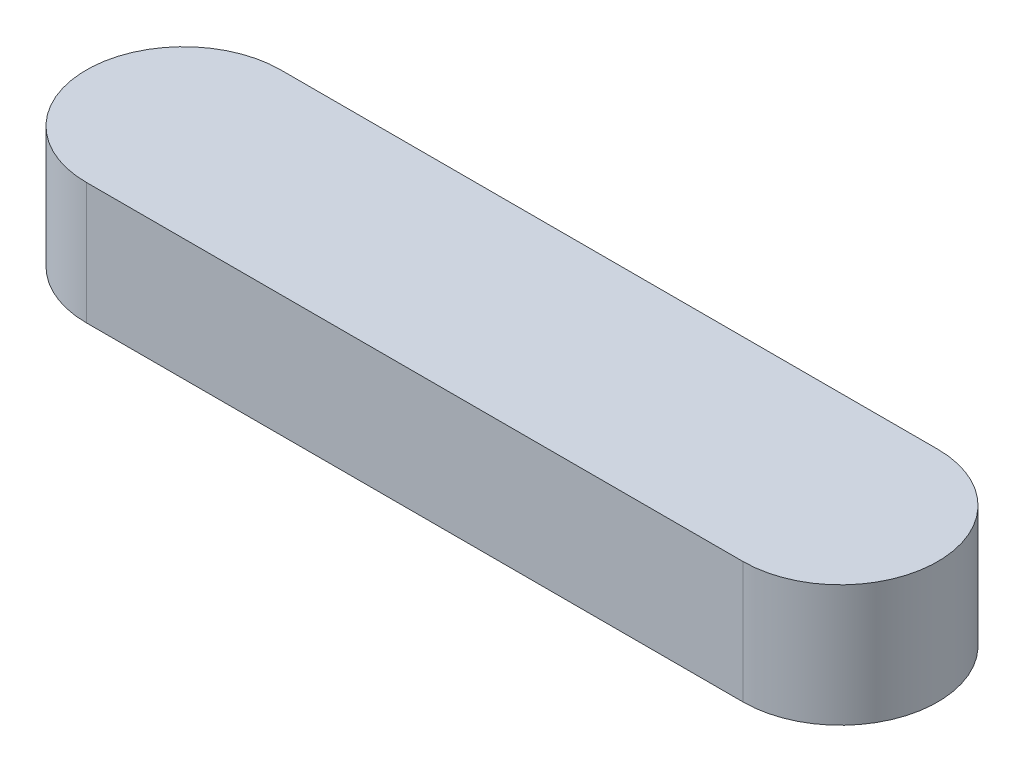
ISO-10303-21;
HEADER;
FILE_DESCRIPTION(('STEP AP214'),'2;1');
FILE_NAME('part.step','',(''),(''),'','','');
FILE_SCHEMA(('AUTOMOTIVE_DESIGN { 1 0 10303 214 1 1 1 1 }'));
ENDSEC;
DATA;
#1=APPLICATION_CONTEXT('core data for automotive mechanical design processes');
#2=APPLICATION_PROTOCOL_DEFINITION('international standard','automotive_design',2000,#1);
#3=PRODUCT_CONTEXT('',#1,'mechanical');
#4=PRODUCT('Part','Part','',(#3));
#5=PRODUCT_RELATED_PRODUCT_CATEGORY('part','',(#4));
#6=PRODUCT_DEFINITION_FORMATION('','',#4);
#7=PRODUCT_DEFINITION_CONTEXT('part definition',#1,'design');
#8=PRODUCT_DEFINITION('design','',#6,#7);
#9=PRODUCT_DEFINITION_SHAPE('','',#8);
#10=(LENGTH_UNIT() NAMED_UNIT(*) SI_UNIT(.MILLI.,.METRE.));
#11=(NAMED_UNIT(*) PLANE_ANGLE_UNIT() SI_UNIT($,.RADIAN.));
#12=(NAMED_UNIT(*) SI_UNIT($,.STERADIAN.) SOLID_ANGLE_UNIT());
#13=UNCERTAINTY_MEASURE_WITH_UNIT(LENGTH_MEASURE(1.E-05),#10,'distance_accuracy_value','');
#14=(GEOMETRIC_REPRESENTATION_CONTEXT(3) GLOBAL_UNCERTAINTY_ASSIGNED_CONTEXT((#13)) GLOBAL_UNIT_ASSIGNED_CONTEXT((#10,
#11,#12)) REPRESENTATION_CONTEXT('',''));
#15=CARTESIAN_POINT('',(0.,0.,0.));
#16=DIRECTION('',(0.,0.,1.));
#17=DIRECTION('',(1.,0.,0.));
#18=AXIS2_PLACEMENT_3D('',#15,#16,#17);
#19=CARTESIAN_POINT('',(54.,10.,0.));
#20=DIRECTION('',(0.,-1.,0.));
#21=DIRECTION('',(0.,0.,-1.));
#22=AXIS2_PLACEMENT_3D('',#19,#20,#21);
#23=CYLINDRICAL_SURFACE('',#22,8.00000000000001);
#24=CARTESIAN_POINT('',(54.,0.,0.));
#25=DIRECTION('',(0.,1.,0.));
#26=DIRECTION('',(0.,0.,1.));
#27=AXIS2_PLACEMENT_3D('',#24,#25,#26);
#28=CIRCLE('',#27,8.00000000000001);
#29=CARTESIAN_POINT('',(54.,0.,8.00000000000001));
#30=VERTEX_POINT('',#29);
#31=CARTESIAN_POINT('',(54.,0.,-8.00000000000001));
#32=VERTEX_POINT('',#31);
#33=EDGE_CURVE('E95',#30,#32,#28,.T.);
#34=ORIENTED_EDGE('',*,*,#33,.T.);
#35=DIRECTION('',(0.,-1.,0.));
#36=VECTOR('',#35,1.);
#37=CARTESIAN_POINT('',(54.,10.,-8.00000000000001));
#38=LINE('',#37,#36);
#39=CARTESIAN_POINT('',(54.,10.,-8.00000000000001));
#40=VERTEX_POINT('',#39);
#41=EDGE_CURVE('E11',#40,#32,#38,.T.);
#42=ORIENTED_EDGE('',*,*,#41,.F.);
#43=CARTESIAN_POINT('',(54.,10.,0.));
#44=DIRECTION('',(0.,1.,0.));
#45=DIRECTION('',(0.,0.,1.));
#46=AXIS2_PLACEMENT_3D('',#43,#44,#45);
#47=CIRCLE('',#46,8.00000000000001);
#48=CARTESIAN_POINT('',(54.,10.,8.00000000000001));
#49=VERTEX_POINT('',#48);
#50=EDGE_CURVE('E83',#49,#40,#47,.T.);
#51=ORIENTED_EDGE('',*,*,#50,.F.);
#52=DIRECTION('',(0.,-1.,0.));
#53=VECTOR('',#52,1.);
#54=CARTESIAN_POINT('',(54.,10.,8.00000000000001));
#55=LINE('',#54,#53);
#56=EDGE_CURVE('E91',#49,#30,#55,.T.);
#57=ORIENTED_EDGE('',*,*,#56,.T.);
#58=EDGE_LOOP('',(#34,#42,#51,#57));
#59=FACE_BOUND('',#58,.T.);
#60=ADVANCED_FACE('F32',(#59),#23,.T.);
#61=CARTESIAN_POINT('',(54.,10.,-8.00000000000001));
#62=DIRECTION('',(0.,0.,1.));
#63=DIRECTION('',(1.,0.,0.));
#64=AXIS2_PLACEMENT_3D('',#61,#62,#63);
#65=PLANE('',#64);
#66=DIRECTION('',(-1.,0.,0.));
#67=VECTOR('',#66,1.);
#68=CARTESIAN_POINT('',(54.,0.,-8.00000000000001));
#69=LINE('',#68,#67);
#70=CARTESIAN_POINT('',(0.,0.,-8.00000000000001));
#71=VERTEX_POINT('',#70);
#72=EDGE_CURVE('E87',#32,#71,#69,.T.);
#73=ORIENTED_EDGE('',*,*,#72,.T.);
#74=DIRECTION('',(0.,-1.,0.));
#75=VECTOR('',#74,1.);
#76=CARTESIAN_POINT('',(0.,10.,-8.00000000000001));
#77=LINE('',#76,#75);
#78=CARTESIAN_POINT('',(0.,10.,-8.00000000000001));
#79=VERTEX_POINT('',#78);
#80=EDGE_CURVE('E40',#79,#71,#77,.T.);
#81=ORIENTED_EDGE('',*,*,#80,.F.);
#82=DIRECTION('',(-1.,0.,0.));
#83=VECTOR('',#82,1.);
#84=CARTESIAN_POINT('',(54.,10.,-8.00000000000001));
#85=LINE('',#84,#83);
#86=EDGE_CURVE('E78',#40,#79,#85,.T.);
#87=ORIENTED_EDGE('',*,*,#86,.F.);
#88=ORIENTED_EDGE('',*,*,#41,.T.);
#89=EDGE_LOOP('',(#73,#81,#87,#88));
#90=FACE_BOUND('',#89,.T.);
#91=ADVANCED_FACE('F86',(#90),#65,.F.);
#92=CARTESIAN_POINT('',(0.,10.,0.));
#93=DIRECTION('',(0.,-1.,0.));
#94=DIRECTION('',(0.,0.,-1.));
#95=AXIS2_PLACEMENT_3D('',#92,#93,#94);
#96=CYLINDRICAL_SURFACE('',#95,8.00000000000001);
#97=CARTESIAN_POINT('',(0.,0.,0.));
#98=DIRECTION('',(0.,1.,0.));
#99=DIRECTION('',(0.,0.,1.));
#100=AXIS2_PLACEMENT_3D('',#97,#98,#99);
#101=CIRCLE('',#100,8.00000000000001);
#102=CARTESIAN_POINT('',(0.,0.,8.00000000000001));
#103=VERTEX_POINT('',#102);
#104=EDGE_CURVE('E65',#71,#103,#101,.T.);
#105=ORIENTED_EDGE('',*,*,#104,.T.);
#106=DIRECTION('',(0.,-1.,0.));
#107=VECTOR('',#106,1.);
#108=CARTESIAN_POINT('',(0.,10.,8.00000000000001));
#109=LINE('',#108,#107);
#110=CARTESIAN_POINT('',(0.,10.,8.00000000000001));
#111=VERTEX_POINT('',#110);
#112=EDGE_CURVE('E88',#111,#103,#109,.T.);
#113=ORIENTED_EDGE('',*,*,#112,.F.);
#114=CARTESIAN_POINT('',(0.,10.,0.));
#115=DIRECTION('',(0.,1.,0.));
#116=DIRECTION('',(0.,0.,1.));
#117=AXIS2_PLACEMENT_3D('',#114,#115,#116);
#118=CIRCLE('',#117,8.00000000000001);
#119=EDGE_CURVE('E81',#79,#111,#118,.T.);
#120=ORIENTED_EDGE('',*,*,#119,.F.);
#121=ORIENTED_EDGE('',*,*,#80,.T.);
#122=EDGE_LOOP('',(#105,#113,#120,#121));
#123=FACE_BOUND('',#122,.T.);
#124=ADVANCED_FACE('F89',(#123),#96,.T.);
#125=CARTESIAN_POINT('',(0.,10.,8.00000000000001));
#126=DIRECTION('',(0.,0.,-1.));
#127=DIRECTION('',(-1.,0.,0.));
#128=AXIS2_PLACEMENT_3D('',#125,#126,#127);
#129=PLANE('',#128);
#130=DIRECTION('',(1.,0.,0.));
#131=VECTOR('',#130,1.);
#132=CARTESIAN_POINT('',(0.,0.,8.00000000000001));
#133=LINE('',#132,#131);
#134=EDGE_CURVE('E71',#103,#30,#133,.T.);
#135=ORIENTED_EDGE('',*,*,#134,.T.);
#136=ORIENTED_EDGE('',*,*,#56,.F.);
#137=DIRECTION('',(1.,0.,0.));
#138=VECTOR('',#137,1.);
#139=CARTESIAN_POINT('',(0.,10.,8.00000000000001));
#140=LINE('',#139,#138);
#141=EDGE_CURVE('E48',#111,#49,#140,.T.);
#142=ORIENTED_EDGE('',*,*,#141,.F.);
#143=ORIENTED_EDGE('',*,*,#112,.T.);
#144=EDGE_LOOP('',(#135,#136,#142,#143));
#145=FACE_BOUND('',#144,.T.);
#146=ADVANCED_FACE('F102',(#145),#129,.F.);
#147=CARTESIAN_POINT('',(54.,10.,0.));
#148=DIRECTION('',(0.,1.,0.));
#149=DIRECTION('',(0.,0.,1.));
#150=AXIS2_PLACEMENT_3D('',#147,#148,#149);
#151=PLANE('',#150);
#152=ORIENTED_EDGE('',*,*,#50,.T.);
#153=ORIENTED_EDGE('',*,*,#86,.T.);
#154=ORIENTED_EDGE('',*,*,#119,.T.);
#155=ORIENTED_EDGE('',*,*,#141,.T.);
#156=EDGE_LOOP('',(#152,#153,#154,#155));
#157=FACE_BOUND('',#156,.T.);
#158=ADVANCED_FACE('F79',(#157),#151,.T.);
#159=CARTESIAN_POINT('',(54.,0.,0.));
#160=DIRECTION('',(0.,1.,0.));
#161=DIRECTION('',(0.,0.,1.));
#162=AXIS2_PLACEMENT_3D('',#159,#160,#161);
#163=PLANE('',#162);
#164=ORIENTED_EDGE('',*,*,#33,.F.);
#165=ORIENTED_EDGE('',*,*,#134,.F.);
#166=ORIENTED_EDGE('',*,*,#104,.F.);
#167=ORIENTED_EDGE('',*,*,#72,.F.);
#168=EDGE_LOOP('',(#164,#165,#166,#167));
#169=FACE_BOUND('',#168,.T.);
#170=ADVANCED_FACE('F105',(#169),#163,.F.);
#171=CLOSED_SHELL('',(#60,#91,#124,#146,#158,#170));
#172=MANIFOLD_SOLID_BREP('B2',#171);
#173=ADVANCED_BREP_SHAPE_REPRESENTATION('',(#18,#172),#14);
#174=SHAPE_DEFINITION_REPRESENTATION(#9,#173);
ENDSEC;
END-ISO-10303-21;
